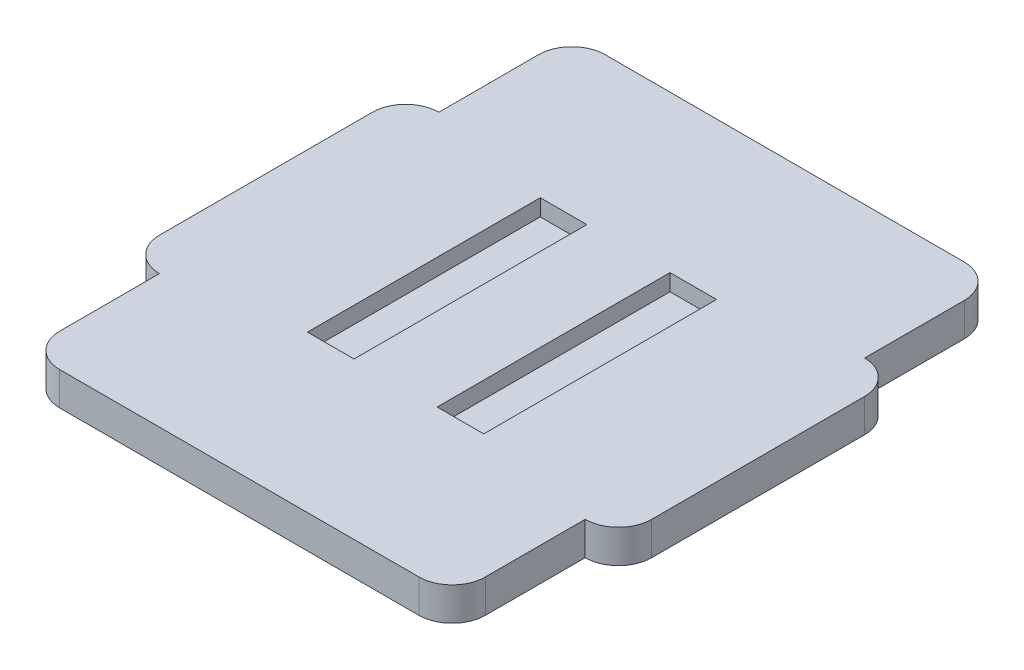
ISO-10303-21;
HEADER;
FILE_DESCRIPTION(('STEP AP214'),'2;1');
FILE_NAME('part.step','',(''),(''),'','','');
FILE_SCHEMA(('AUTOMOTIVE_DESIGN { 1 0 10303 214 1 1 1 1 }'));
ENDSEC;
DATA;
#1=APPLICATION_CONTEXT('core data for automotive mechanical design processes');
#2=APPLICATION_PROTOCOL_DEFINITION('international standard','automotive_design',2000,#1);
#3=PRODUCT_CONTEXT('',#1,'mechanical');
#4=PRODUCT('Part','Part','',(#3));
#5=PRODUCT_RELATED_PRODUCT_CATEGORY('part','',(#4));
#6=PRODUCT_DEFINITION_FORMATION('','',#4);
#7=PRODUCT_DEFINITION_CONTEXT('part definition',#1,'design');
#8=PRODUCT_DEFINITION('design','',#6,#7);
#9=PRODUCT_DEFINITION_SHAPE('','',#8);
#10=(LENGTH_UNIT() NAMED_UNIT(*) SI_UNIT(.MILLI.,.METRE.));
#11=(NAMED_UNIT(*) PLANE_ANGLE_UNIT() SI_UNIT($,.RADIAN.));
#12=(NAMED_UNIT(*) SI_UNIT($,.STERADIAN.) SOLID_ANGLE_UNIT());
#13=UNCERTAINTY_MEASURE_WITH_UNIT(LENGTH_MEASURE(1.E-05),#10,'distance_accuracy_value','');
#14=(GEOMETRIC_REPRESENTATION_CONTEXT(3) GLOBAL_UNCERTAINTY_ASSIGNED_CONTEXT((#13)) GLOBAL_UNIT_ASSIGNED_CONTEXT((#10,
#11,#12)) REPRESENTATION_CONTEXT('',''));
#15=CARTESIAN_POINT('',(0.,0.,0.));
#16=DIRECTION('',(0.,0.,1.));
#17=DIRECTION('',(1.,0.,0.));
#18=AXIS2_PLACEMENT_3D('',#15,#16,#17);
#19=CARTESIAN_POINT('',(46.,5.,-37.));
#20=DIRECTION('',(0.,-1.,0.));
#21=DIRECTION('',(0.,0.,-1.));
#22=AXIS2_PLACEMENT_3D('',#19,#20,#21);
#23=CYLINDRICAL_SURFACE('',#22,5.);
#24=CARTESIAN_POINT('',(46.,0.,-37.));
#25=DIRECTION('',(0.,1.,0.));
#26=DIRECTION('',(0.,0.,1.));
#27=AXIS2_PLACEMENT_3D('',#24,#25,#26);
#28=CIRCLE('',#27,5.);
#29=CARTESIAN_POINT('',(51.,0.,-37.));
#30=VERTEX_POINT('',#29);
#31=CARTESIAN_POINT('',(46.,0.,-42.));
#32=VERTEX_POINT('',#31);
#33=EDGE_CURVE('E251',#30,#32,#28,.T.);
#34=ORIENTED_EDGE('',*,*,#33,.T.);
#35=DIRECTION('',(0.,-1.,0.));
#36=VECTOR('',#35,1.);
#37=CARTESIAN_POINT('',(46.,5.,-42.));
#38=LINE('',#37,#36);
#39=CARTESIAN_POINT('',(46.,5.,-42.));
#40=VERTEX_POINT('',#39);
#41=EDGE_CURVE('E11',#40,#32,#38,.T.);
#42=ORIENTED_EDGE('',*,*,#41,.F.);
#43=CARTESIAN_POINT('',(46.,5.,-37.));
#44=DIRECTION('',(0.,1.,0.));
#45=DIRECTION('',(0.,0.,1.));
#46=AXIS2_PLACEMENT_3D('',#43,#44,#45);
#47=CIRCLE('',#46,5.);
#48=CARTESIAN_POINT('',(51.,5.,-37.));
#49=VERTEX_POINT('',#48);
#50=EDGE_CURVE('E299',#49,#40,#47,.T.);
#51=ORIENTED_EDGE('',*,*,#50,.F.);
#52=DIRECTION('',(0.,-1.,0.));
#53=VECTOR('',#52,1.);
#54=CARTESIAN_POINT('',(51.,5.,-37.));
#55=LINE('',#54,#53);
#56=EDGE_CURVE('E357',#49,#30,#55,.T.);
#57=ORIENTED_EDGE('',*,*,#56,.T.);
#58=EDGE_LOOP('',(#34,#42,#51,#57));
#59=FACE_BOUND('',#58,.T.);
#60=ADVANCED_FACE('F45',(#59),#23,.T.);
#61=CARTESIAN_POINT('',(46.,5.,0.));
#62=DIRECTION('',(-1.,0.,0.));
#63=DIRECTION('',(0.,0.,1.));
#64=AXIS2_PLACEMENT_3D('',#61,#62,#63);
#65=PLANE('',#64);
#66=DIRECTION('',(0.,0.,-1.));
#67=VECTOR('',#66,1.);
#68=CARTESIAN_POINT('',(46.,0.,0.));
#69=LINE('',#68,#67);
#70=CARTESIAN_POINT('',(46.,0.,-57.));
#71=VERTEX_POINT('',#70);
#72=EDGE_CURVE('E361',#32,#71,#69,.T.);
#73=ORIENTED_EDGE('',*,*,#72,.T.);
#74=DIRECTION('',(0.,-1.,0.));
#75=VECTOR('',#74,1.);
#76=CARTESIAN_POINT('',(46.,5.,-57.));
#77=LINE('',#76,#75);
#78=CARTESIAN_POINT('',(46.,5.,-57.));
#79=VERTEX_POINT('',#78);
#80=EDGE_CURVE('E53',#79,#71,#77,.T.);
#81=ORIENTED_EDGE('',*,*,#80,.F.);
#82=DIRECTION('',(0.,0.,-1.));
#83=VECTOR('',#82,1.);
#84=CARTESIAN_POINT('',(46.,5.,0.));
#85=LINE('',#84,#83);
#86=EDGE_CURVE('E303',#40,#79,#85,.T.);
#87=ORIENTED_EDGE('',*,*,#86,.F.);
#88=ORIENTED_EDGE('',*,*,#41,.T.);
#89=EDGE_LOOP('',(#73,#81,#87,#88));
#90=FACE_BOUND('',#89,.T.);
#91=ADVANCED_FACE('F484',(#90),#65,.F.);
#92=CARTESIAN_POINT('',(41.,5.,-57.));
#93=DIRECTION('',(0.,-1.,0.));
#94=DIRECTION('',(0.,0.,-1.));
#95=AXIS2_PLACEMENT_3D('',#92,#93,#94);
#96=CYLINDRICAL_SURFACE('',#95,5.);
#97=CARTESIAN_POINT('',(41.,0.,-57.));
#98=DIRECTION('',(0.,1.,0.));
#99=DIRECTION('',(0.,0.,1.));
#100=AXIS2_PLACEMENT_3D('',#97,#98,#99);
#101=CIRCLE('',#100,5.);
#102=CARTESIAN_POINT('',(41.,0.,-62.));
#103=VERTEX_POINT('',#102);
#104=EDGE_CURVE('E364',#71,#103,#101,.T.);
#105=ORIENTED_EDGE('',*,*,#104,.T.);
#106=DIRECTION('',(0.,-1.,0.));
#107=VECTOR('',#106,1.);
#108=CARTESIAN_POINT('',(41.,5.,-62.));
#109=LINE('',#108,#107);
#110=CARTESIAN_POINT('',(41.,5.,-62.));
#111=VERTEX_POINT('',#110);
#112=EDGE_CURVE('E457',#111,#103,#109,.T.);
#113=ORIENTED_EDGE('',*,*,#112,.F.);
#114=CARTESIAN_POINT('',(41.,5.,-57.));
#115=DIRECTION('',(0.,1.,0.));
#116=DIRECTION('',(0.,0.,1.));
#117=AXIS2_PLACEMENT_3D('',#114,#115,#116);
#118=CIRCLE('',#117,5.);
#119=EDGE_CURVE('E307',#79,#111,#118,.T.);
#120=ORIENTED_EDGE('',*,*,#119,.F.);
#121=ORIENTED_EDGE('',*,*,#80,.T.);
#122=EDGE_LOOP('',(#105,#113,#120,#121));
#123=FACE_BOUND('',#122,.T.);
#124=ADVANCED_FACE('F465',(#123),#96,.T.);
#125=CARTESIAN_POINT('',(0.,5.,-62.));
#126=DIRECTION('',(0.,0.,-1.));
#127=DIRECTION('',(-1.,0.,0.));
#128=AXIS2_PLACEMENT_3D('',#125,#126,#127);
#129=PLANE('',#128);
#130=DIRECTION('',(1.,0.,0.));
#131=VECTOR('',#130,1.);
#132=CARTESIAN_POINT('',(0.,0.,-62.));
#133=LINE('',#132,#131);
#134=CARTESIAN_POINT('',(-13.,0.,-62.));
#135=VERTEX_POINT('',#134);
#136=EDGE_CURVE('E368',#135,#103,#133,.T.);
#137=ORIENTED_EDGE('',*,*,#136,.F.);
#138=DIRECTION('',(0.,-1.,0.));
#139=VECTOR('',#138,1.);
#140=CARTESIAN_POINT('',(-13.,5.,-62.));
#141=LINE('',#140,#139);
#142=CARTESIAN_POINT('',(-13.,5.,-62.));
#143=VERTEX_POINT('',#142);
#144=EDGE_CURVE('E454',#143,#135,#141,.T.);
#145=ORIENTED_EDGE('',*,*,#144,.F.);
#146=DIRECTION('',(1.,0.,0.));
#147=VECTOR('',#146,1.);
#148=CARTESIAN_POINT('',(0.,5.,-62.));
#149=LINE('',#148,#147);
#150=EDGE_CURVE('E310',#143,#111,#149,.T.);
#151=ORIENTED_EDGE('',*,*,#150,.T.);
#152=ORIENTED_EDGE('',*,*,#112,.T.);
#153=EDGE_LOOP('',(#137,#145,#151,#152));
#154=FACE_BOUND('',#153,.T.);
#155=ADVANCED_FACE('F474',(#154),#129,.T.);
#156=CARTESIAN_POINT('',(-13.,5.,-57.));
#157=DIRECTION('',(0.,-1.,0.));
#158=DIRECTION('',(0.,0.,-1.));
#159=AXIS2_PLACEMENT_3D('',#156,#157,#158);
#160=CYLINDRICAL_SURFACE('',#159,5.);
#161=CARTESIAN_POINT('',(-13.,0.,-57.));
#162=DIRECTION('',(0.,1.,0.));
#163=DIRECTION('',(0.,0.,1.));
#164=AXIS2_PLACEMENT_3D('',#161,#162,#163);
#165=CIRCLE('',#164,5.);
#166=CARTESIAN_POINT('',(-18.,0.,-57.));
#167=VERTEX_POINT('',#166);
#168=EDGE_CURVE('E372',#135,#167,#165,.T.);
#169=ORIENTED_EDGE('',*,*,#168,.T.);
#170=DIRECTION('',(0.,-1.,0.));
#171=VECTOR('',#170,1.);
#172=CARTESIAN_POINT('',(-18.,5.,-57.));
#173=LINE('',#172,#171);
#174=CARTESIAN_POINT('',(-18.,5.,-57.));
#175=VERTEX_POINT('',#174);
#176=EDGE_CURVE('E451',#175,#167,#173,.T.);
#177=ORIENTED_EDGE('',*,*,#176,.F.);
#178=CARTESIAN_POINT('',(-13.,5.,-57.));
#179=DIRECTION('',(0.,1.,0.));
#180=DIRECTION('',(0.,0.,1.));
#181=AXIS2_PLACEMENT_3D('',#178,#179,#180);
#182=CIRCLE('',#181,5.);
#183=EDGE_CURVE('E314',#143,#175,#182,.T.);
#184=ORIENTED_EDGE('',*,*,#183,.F.);
#185=ORIENTED_EDGE('',*,*,#144,.T.);
#186=EDGE_LOOP('',(#169,#177,#184,#185));
#187=FACE_BOUND('',#186,.T.);
#188=ADVANCED_FACE('F532',(#187),#160,.T.);
#189=CARTESIAN_POINT('',(-18.,5.,0.));
#190=DIRECTION('',(-1.,0.,0.));
#191=DIRECTION('',(0.,0.,1.));
#192=AXIS2_PLACEMENT_3D('',#189,#190,#191);
#193=PLANE('',#192);
#194=DIRECTION('',(0.,0.,-1.));
#195=VECTOR('',#194,1.);
#196=CARTESIAN_POINT('',(-18.,0.,0.));
#197=LINE('',#196,#195);
#198=CARTESIAN_POINT('',(-18.,0.,-42.));
#199=VERTEX_POINT('',#198);
#200=EDGE_CURVE('E376',#199,#167,#197,.T.);
#201=ORIENTED_EDGE('',*,*,#200,.F.);
#202=DIRECTION('',(0.,-1.,0.));
#203=VECTOR('',#202,1.);
#204=CARTESIAN_POINT('',(-18.,5.,-42.));
#205=LINE('',#204,#203);
#206=CARTESIAN_POINT('',(-18.,5.,-42.));
#207=VERTEX_POINT('',#206);
#208=EDGE_CURVE('E448',#207,#199,#205,.T.);
#209=ORIENTED_EDGE('',*,*,#208,.F.);
#210=DIRECTION('',(0.,0.,-1.));
#211=VECTOR('',#210,1.);
#212=CARTESIAN_POINT('',(-18.,5.,0.));
#213=LINE('',#212,#211);
#214=EDGE_CURVE('E317',#207,#175,#213,.T.);
#215=ORIENTED_EDGE('',*,*,#214,.T.);
#216=ORIENTED_EDGE('',*,*,#176,.T.);
#217=EDGE_LOOP('',(#201,#209,#215,#216));
#218=FACE_BOUND('',#217,.T.);
#219=ADVANCED_FACE('F530',(#218),#193,.T.);
#220=CARTESIAN_POINT('',(-18.,5.,-37.));
#221=DIRECTION('',(0.,-1.,0.));
#222=DIRECTION('',(0.,0.,-1.));
#223=AXIS2_PLACEMENT_3D('',#220,#221,#222);
#224=CYLINDRICAL_SURFACE('',#223,5.);
#225=CARTESIAN_POINT('',(-18.,0.,-37.));
#226=DIRECTION('',(0.,1.,0.));
#227=DIRECTION('',(0.,0.,1.));
#228=AXIS2_PLACEMENT_3D('',#225,#226,#227);
#229=CIRCLE('',#228,5.);
#230=CARTESIAN_POINT('',(-23.,0.,-37.));
#231=VERTEX_POINT('',#230);
#232=EDGE_CURVE('E380',#231,#199,#229,.F.);
#233=ORIENTED_EDGE('',*,*,#232,.F.);
#234=DIRECTION('',(0.,-1.,0.));
#235=VECTOR('',#234,1.);
#236=CARTESIAN_POINT('',(-23.,5.,-37.));
#237=LINE('',#236,#235);
#238=CARTESIAN_POINT('',(-23.,5.,-37.));
#239=VERTEX_POINT('',#238);
#240=EDGE_CURVE('E445',#239,#231,#237,.T.);
#241=ORIENTED_EDGE('',*,*,#240,.F.);
#242=CARTESIAN_POINT('',(-18.,5.,-37.));
#243=DIRECTION('',(0.,1.,0.));
#244=DIRECTION('',(0.,0.,1.));
#245=AXIS2_PLACEMENT_3D('',#242,#243,#244);
#246=CIRCLE('',#245,5.);
#247=EDGE_CURVE('E321',#239,#207,#246,.F.);
#248=ORIENTED_EDGE('',*,*,#247,.T.);
#249=ORIENTED_EDGE('',*,*,#208,.T.);
#250=EDGE_LOOP('',(#233,#241,#248,#249));
#251=FACE_BOUND('',#250,.T.);
#252=ADVANCED_FACE('F527',(#251),#224,.T.);
#253=CARTESIAN_POINT('',(-23.,5.,0.));
#254=DIRECTION('',(-1.,0.,0.));
#255=DIRECTION('',(0.,0.,1.));
#256=AXIS2_PLACEMENT_3D('',#253,#254,#255);
#257=PLANE('',#256);
#258=DIRECTION('',(0.,0.,-1.));
#259=VECTOR('',#258,1.);
#260=CARTESIAN_POINT('',(-23.,0.,0.));
#261=LINE('',#260,#259);
#262=CARTESIAN_POINT('',(-23.,0.,-5.));
#263=VERTEX_POINT('',#262);
#264=EDGE_CURVE('E384',#263,#231,#261,.T.);
#265=ORIENTED_EDGE('',*,*,#264,.F.);
#266=DIRECTION('',(0.,-1.,0.));
#267=VECTOR('',#266,1.);
#268=CARTESIAN_POINT('',(-23.,5.,-5.));
#269=LINE('',#268,#267);
#270=CARTESIAN_POINT('',(-23.,5.,-5.));
#271=VERTEX_POINT('',#270);
#272=EDGE_CURVE('E442',#271,#263,#269,.T.);
#273=ORIENTED_EDGE('',*,*,#272,.F.);
#274=DIRECTION('',(0.,0.,-1.));
#275=VECTOR('',#274,1.);
#276=CARTESIAN_POINT('',(-23.,5.,0.));
#277=LINE('',#276,#275);
#278=EDGE_CURVE('E325',#271,#239,#277,.T.);
#279=ORIENTED_EDGE('',*,*,#278,.T.);
#280=ORIENTED_EDGE('',*,*,#240,.T.);
#281=EDGE_LOOP('',(#265,#273,#279,#280));
#282=FACE_BOUND('',#281,.T.);
#283=ADVANCED_FACE('F523',(#282),#257,.T.);
#284=CARTESIAN_POINT('',(-18.,5.,-5.));
#285=DIRECTION('',(0.,-1.,0.));
#286=DIRECTION('',(0.,0.,-1.));
#287=AXIS2_PLACEMENT_3D('',#284,#285,#286);
#288=CYLINDRICAL_SURFACE('',#287,5.);
#289=CARTESIAN_POINT('',(-18.,0.,-5.));
#290=DIRECTION('',(0.,1.,0.));
#291=DIRECTION('',(0.,0.,1.));
#292=AXIS2_PLACEMENT_3D('',#289,#290,#291);
#293=CIRCLE('',#292,5.);
#294=CARTESIAN_POINT('',(-18.,0.,0.));
#295=VERTEX_POINT('',#294);
#296=EDGE_CURVE('E388',#295,#263,#293,.F.);
#297=ORIENTED_EDGE('',*,*,#296,.F.);
#298=DIRECTION('',(0.,-1.,0.));
#299=VECTOR('',#298,1.);
#300=CARTESIAN_POINT('',(-18.,5.,0.));
#301=LINE('',#300,#299);
#302=CARTESIAN_POINT('',(-18.,5.,0.));
#303=VERTEX_POINT('',#302);
#304=EDGE_CURVE('E439',#303,#295,#301,.T.);
#305=ORIENTED_EDGE('',*,*,#304,.F.);
#306=CARTESIAN_POINT('',(-18.,5.,-5.));
#307=DIRECTION('',(0.,1.,0.));
#308=DIRECTION('',(0.,0.,1.));
#309=AXIS2_PLACEMENT_3D('',#306,#307,#308);
#310=CIRCLE('',#309,5.);
#311=EDGE_CURVE('E329',#303,#271,#310,.F.);
#312=ORIENTED_EDGE('',*,*,#311,.T.);
#313=ORIENTED_EDGE('',*,*,#272,.T.);
#314=EDGE_LOOP('',(#297,#305,#312,#313));
#315=FACE_BOUND('',#314,.T.);
#316=ADVANCED_FACE('F518',(#315),#288,.T.);
#317=CARTESIAN_POINT('',(-18.,5.,0.));
#318=DIRECTION('',(1.,0.,0.));
#319=DIRECTION('',(0.,0.,-1.));
#320=AXIS2_PLACEMENT_3D('',#317,#318,#319);
#321=PLANE('',#320);
#322=DIRECTION('',(0.,0.,1.));
#323=VECTOR('',#322,1.);
#324=CARTESIAN_POINT('',(-18.,0.,0.));
#325=LINE('',#324,#323);
#326=CARTESIAN_POINT('',(-18.,0.,15.));
#327=VERTEX_POINT('',#326);
#328=EDGE_CURVE('E392',#295,#327,#325,.T.);
#329=ORIENTED_EDGE('',*,*,#328,.T.);
#330=DIRECTION('',(0.,-1.,0.));
#331=VECTOR('',#330,1.);
#332=CARTESIAN_POINT('',(-18.,5.,15.));
#333=LINE('',#332,#331);
#334=CARTESIAN_POINT('',(-18.,5.,15.));
#335=VERTEX_POINT('',#334);
#336=EDGE_CURVE('E436',#335,#327,#333,.T.);
#337=ORIENTED_EDGE('',*,*,#336,.F.);
#338=DIRECTION('',(0.,0.,1.));
#339=VECTOR('',#338,1.);
#340=CARTESIAN_POINT('',(-18.,5.,0.));
#341=LINE('',#340,#339);
#342=EDGE_CURVE('E333',#303,#335,#341,.T.);
#343=ORIENTED_EDGE('',*,*,#342,.F.);
#344=ORIENTED_EDGE('',*,*,#304,.T.);
#345=EDGE_LOOP('',(#329,#337,#343,#344));
#346=FACE_BOUND('',#345,.T.);
#347=ADVANCED_FACE('F515',(#346),#321,.F.);
#348=CARTESIAN_POINT('',(-13.,5.,15.));
#349=DIRECTION('',(0.,-1.,0.));
#350=DIRECTION('',(0.,0.,-1.));
#351=AXIS2_PLACEMENT_3D('',#348,#349,#350);
#352=CYLINDRICAL_SURFACE('',#351,5.);
#353=CARTESIAN_POINT('',(-13.,0.,15.));
#354=DIRECTION('',(0.,1.,0.));
#355=DIRECTION('',(0.,0.,1.));
#356=AXIS2_PLACEMENT_3D('',#353,#354,#355);
#357=CIRCLE('',#356,5.);
#358=CARTESIAN_POINT('',(-13.,0.,20.));
#359=VERTEX_POINT('',#358);
#360=EDGE_CURVE('E396',#359,#327,#357,.F.);
#361=ORIENTED_EDGE('',*,*,#360,.F.);
#362=DIRECTION('',(0.,-1.,0.));
#363=VECTOR('',#362,1.);
#364=CARTESIAN_POINT('',(-13.,5.,20.));
#365=LINE('',#364,#363);
#366=CARTESIAN_POINT('',(-13.,5.,20.));
#367=VERTEX_POINT('',#366);
#368=EDGE_CURVE('E433',#367,#359,#365,.T.);
#369=ORIENTED_EDGE('',*,*,#368,.F.);
#370=CARTESIAN_POINT('',(-13.,5.,15.));
#371=DIRECTION('',(0.,1.,0.));
#372=DIRECTION('',(0.,0.,1.));
#373=AXIS2_PLACEMENT_3D('',#370,#371,#372);
#374=CIRCLE('',#373,5.);
#375=EDGE_CURVE('E336',#367,#335,#374,.F.);
#376=ORIENTED_EDGE('',*,*,#375,.T.);
#377=ORIENTED_EDGE('',*,*,#336,.T.);
#378=EDGE_LOOP('',(#361,#369,#376,#377));
#379=FACE_BOUND('',#378,.T.);
#380=ADVANCED_FACE('F509',(#379),#352,.T.);
#381=CARTESIAN_POINT('',(0.,5.,20.));
#382=DIRECTION('',(0.,0.,-1.));
#383=DIRECTION('',(-1.,0.,0.));
#384=AXIS2_PLACEMENT_3D('',#381,#382,#383);
#385=PLANE('',#384);
#386=DIRECTION('',(1.,0.,0.));
#387=VECTOR('',#386,1.);
#388=CARTESIAN_POINT('',(0.,0.,20.));
#389=LINE('',#388,#387);
#390=CARTESIAN_POINT('',(41.,0.,20.));
#391=VERTEX_POINT('',#390);
#392=EDGE_CURVE('E400',#359,#391,#389,.T.);
#393=ORIENTED_EDGE('',*,*,#392,.T.);
#394=DIRECTION('',(0.,-1.,0.));
#395=VECTOR('',#394,1.);
#396=CARTESIAN_POINT('',(41.,5.,20.));
#397=LINE('',#396,#395);
#398=CARTESIAN_POINT('',(41.,5.,20.));
#399=VERTEX_POINT('',#398);
#400=EDGE_CURVE('E429',#399,#391,#397,.T.);
#401=ORIENTED_EDGE('',*,*,#400,.F.);
#402=DIRECTION('',(1.,0.,0.));
#403=VECTOR('',#402,1.);
#404=CARTESIAN_POINT('',(0.,5.,20.));
#405=LINE('',#404,#403);
#406=EDGE_CURVE('E340',#367,#399,#405,.T.);
#407=ORIENTED_EDGE('',*,*,#406,.F.);
#408=ORIENTED_EDGE('',*,*,#368,.T.);
#409=EDGE_LOOP('',(#393,#401,#407,#408));
#410=FACE_BOUND('',#409,.T.);
#411=ADVANCED_FACE('F613',(#410),#385,.F.);
#412=CARTESIAN_POINT('',(41.,5.,15.));
#413=DIRECTION('',(0.,-1.,0.));
#414=DIRECTION('',(0.,0.,-1.));
#415=AXIS2_PLACEMENT_3D('',#412,#413,#414);
#416=CYLINDRICAL_SURFACE('',#415,5.);
#417=CARTESIAN_POINT('',(41.,0.,15.));
#418=DIRECTION('',(0.,1.,0.));
#419=DIRECTION('',(0.,0.,1.));
#420=AXIS2_PLACEMENT_3D('',#417,#418,#419);
#421=CIRCLE('',#420,5.);
#422=CARTESIAN_POINT('',(46.,0.,15.));
#423=VERTEX_POINT('',#422);
#424=EDGE_CURVE('E403',#391,#423,#421,.T.);
#425=ORIENTED_EDGE('',*,*,#424,.T.);
#426=DIRECTION('',(0.,-1.,0.));
#427=VECTOR('',#426,1.);
#428=CARTESIAN_POINT('',(46.,5.,15.));
#429=LINE('',#428,#427);
#430=CARTESIAN_POINT('',(46.,5.,15.));
#431=VERTEX_POINT('',#430);
#432=EDGE_CURVE('E426',#431,#423,#429,.T.);
#433=ORIENTED_EDGE('',*,*,#432,.F.);
#434=CARTESIAN_POINT('',(41.,5.,15.));
#435=DIRECTION('',(0.,1.,0.));
#436=DIRECTION('',(0.,0.,1.));
#437=AXIS2_PLACEMENT_3D('',#434,#435,#436);
#438=CIRCLE('',#437,5.);
#439=EDGE_CURVE('E343',#399,#431,#438,.T.);
#440=ORIENTED_EDGE('',*,*,#439,.F.);
#441=ORIENTED_EDGE('',*,*,#400,.T.);
#442=EDGE_LOOP('',(#425,#433,#440,#441));
#443=FACE_BOUND('',#442,.T.);
#444=ADVANCED_FACE('F502',(#443),#416,.T.);
#445=CARTESIAN_POINT('',(46.,5.,0.));
#446=DIRECTION('',(1.,0.,0.));
#447=DIRECTION('',(0.,0.,-1.));
#448=AXIS2_PLACEMENT_3D('',#445,#446,#447);
#449=PLANE('',#448);
#450=DIRECTION('',(0.,0.,1.));
#451=VECTOR('',#450,1.);
#452=CARTESIAN_POINT('',(46.,0.,0.));
#453=LINE('',#452,#451);
#454=CARTESIAN_POINT('',(46.,0.,0.));
#455=VERTEX_POINT('',#454);
#456=EDGE_CURVE('E407',#455,#423,#453,.T.);
#457=ORIENTED_EDGE('',*,*,#456,.F.);
#458=DIRECTION('',(0.,-1.,0.));
#459=VECTOR('',#458,1.);
#460=CARTESIAN_POINT('',(46.,5.,0.));
#461=LINE('',#460,#459);
#462=CARTESIAN_POINT('',(46.,5.,0.));
#463=VERTEX_POINT('',#462);
#464=EDGE_CURVE('E423',#463,#455,#461,.T.);
#465=ORIENTED_EDGE('',*,*,#464,.F.);
#466=DIRECTION('',(0.,0.,1.));
#467=VECTOR('',#466,1.);
#468=CARTESIAN_POINT('',(46.,5.,0.));
#469=LINE('',#468,#467);
#470=EDGE_CURVE('E346',#463,#431,#469,.T.);
#471=ORIENTED_EDGE('',*,*,#470,.T.);
#472=ORIENTED_EDGE('',*,*,#432,.T.);
#473=EDGE_LOOP('',(#457,#465,#471,#472));
#474=FACE_BOUND('',#473,.T.);
#475=ADVANCED_FACE('F497',(#474),#449,.T.);
#476=CARTESIAN_POINT('',(46.,5.,-5.));
#477=DIRECTION('',(0.,-1.,0.));
#478=DIRECTION('',(0.,0.,-1.));
#479=AXIS2_PLACEMENT_3D('',#476,#477,#478);
#480=CYLINDRICAL_SURFACE('',#479,5.);
#481=CARTESIAN_POINT('',(46.,0.,-5.));
#482=DIRECTION('',(0.,1.,0.));
#483=DIRECTION('',(0.,0.,1.));
#484=AXIS2_PLACEMENT_3D('',#481,#482,#483);
#485=CIRCLE('',#484,5.);
#486=CARTESIAN_POINT('',(51.,0.,-5.00000000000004));
#487=VERTEX_POINT('',#486);
#488=EDGE_CURVE('E411',#455,#487,#485,.T.);
#489=ORIENTED_EDGE('',*,*,#488,.T.);
#490=DIRECTION('',(0.,-1.,0.));
#491=VECTOR('',#490,1.);
#492=CARTESIAN_POINT('',(51.,5.,-5.00000000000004));
#493=LINE('',#492,#491);
#494=CARTESIAN_POINT('',(51.,5.,-5.00000000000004));
#495=VERTEX_POINT('',#494);
#496=EDGE_CURVE('E420',#495,#487,#493,.T.);
#497=ORIENTED_EDGE('',*,*,#496,.F.);
#498=CARTESIAN_POINT('',(46.,5.,-5.));
#499=DIRECTION('',(0.,1.,0.));
#500=DIRECTION('',(0.,0.,1.));
#501=AXIS2_PLACEMENT_3D('',#498,#499,#500);
#502=CIRCLE('',#501,5.);
#503=EDGE_CURVE('E350',#463,#495,#502,.T.);
#504=ORIENTED_EDGE('',*,*,#503,.F.);
#505=ORIENTED_EDGE('',*,*,#464,.T.);
#506=EDGE_LOOP('',(#489,#497,#504,#505));
#507=FACE_BOUND('',#506,.T.);
#508=ADVANCED_FACE('F493',(#507),#480,.T.);
#509=CARTESIAN_POINT('',(51.,5.,0.));
#510=DIRECTION('',(1.,0.,0.));
#511=DIRECTION('',(0.,0.,-1.));
#512=AXIS2_PLACEMENT_3D('',#509,#510,#511);
#513=PLANE('',#512);
#514=DIRECTION('',(0.,0.,1.));
#515=VECTOR('',#514,1.);
#516=CARTESIAN_POINT('',(51.,0.,0.));
#517=LINE('',#516,#515);
#518=EDGE_CURVE('E304',#30,#487,#517,.T.);
#519=ORIENTED_EDGE('',*,*,#518,.F.);
#520=ORIENTED_EDGE('',*,*,#56,.F.);
#521=DIRECTION('',(0.,0.,1.));
#522=VECTOR('',#521,1.);
#523=CARTESIAN_POINT('',(51.,5.,0.));
#524=LINE('',#523,#522);
#525=EDGE_CURVE('E353',#49,#495,#524,.T.);
#526=ORIENTED_EDGE('',*,*,#525,.T.);
#527=ORIENTED_EDGE('',*,*,#496,.T.);
#528=EDGE_LOOP('',(#519,#520,#526,#527));
#529=FACE_BOUND('',#528,.T.);
#530=ADVANCED_FACE('F489',(#529),#513,.T.);
#531=CARTESIAN_POINT('',(0.,5.,0.));
#532=DIRECTION('',(0.,1.,0.));
#533=DIRECTION('',(0.,0.,1.));
#534=AXIS2_PLACEMENT_3D('',#531,#532,#533);
#535=PLANE('',#534);
#536=DIRECTION('',(0.,0.,1.));
#537=VECTOR('',#536,1.);
#538=CARTESIAN_POINT('',(0.750000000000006,5.,-38.5));
#539=LINE('',#538,#537);
#540=CARTESIAN_POINT('',(0.750000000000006,5.,-38.5));
#541=VERTEX_POINT('',#540);
#542=CARTESIAN_POINT('',(0.750000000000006,5.,-3.5));
#543=VERTEX_POINT('',#542);
#544=EDGE_CURVE('E60',#541,#543,#539,.T.);
#545=ORIENTED_EDGE('',*,*,#544,.F.);
#546=DIRECTION('',(-1.,0.,0.));
#547=VECTOR('',#546,1.);
#548=CARTESIAN_POINT('',(0.750000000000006,5.,-38.5));
#549=LINE('',#548,#547);
#550=CARTESIAN_POINT('',(7.75000000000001,5.,-38.5));
#551=VERTEX_POINT('',#550);
#552=EDGE_CURVE('E229',#551,#541,#549,.T.);
#553=ORIENTED_EDGE('',*,*,#552,.F.);
#554=DIRECTION('',(0.,0.,-1.));
#555=VECTOR('',#554,1.);
#556=CARTESIAN_POINT('',(7.75000000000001,5.,-38.5));
#557=LINE('',#556,#555);
#558=CARTESIAN_POINT('',(7.75000000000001,5.,-3.5));
#559=VERTEX_POINT('',#558);
#560=EDGE_CURVE('E233',#559,#551,#557,.T.);
#561=ORIENTED_EDGE('',*,*,#560,.F.);
#562=DIRECTION('',(1.,0.,0.));
#563=VECTOR('',#562,1.);
#564=CARTESIAN_POINT('',(0.750000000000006,5.,-3.5));
#565=LINE('',#564,#563);
#566=EDGE_CURVE('E242',#543,#559,#565,.T.);
#567=ORIENTED_EDGE('',*,*,#566,.F.);
#568=EDGE_LOOP('',(#545,#553,#561,#567));
#569=FACE_BOUND('',#568,.T.);
#570=DIRECTION('',(0.,0.,-1.));
#571=VECTOR('',#570,1.);
#572=CARTESIAN_POINT('',(27.25,5.,-38.5));
#573=LINE('',#572,#571);
#574=CARTESIAN_POINT('',(27.25,5.,-3.5));
#575=VERTEX_POINT('',#574);
#576=CARTESIAN_POINT('',(27.25,5.,-38.5));
#577=VERTEX_POINT('',#576);
#578=EDGE_CURVE('E68',#575,#577,#573,.T.);
#579=ORIENTED_EDGE('',*,*,#578,.F.);
#580=DIRECTION('',(1.,0.,0.));
#581=VECTOR('',#580,1.);
#582=CARTESIAN_POINT('',(27.25,5.,-3.5));
#583=LINE('',#582,#581);
#584=CARTESIAN_POINT('',(20.25,5.,-3.5));
#585=VERTEX_POINT('',#584);
#586=EDGE_CURVE('E270',#585,#575,#583,.T.);
#587=ORIENTED_EDGE('',*,*,#586,.F.);
#588=DIRECTION('',(0.,0.,1.));
#589=VECTOR('',#588,1.);
#590=CARTESIAN_POINT('',(20.25,5.,-38.5));
#591=LINE('',#590,#589);
#592=CARTESIAN_POINT('',(20.25,5.,-38.5));
#593=VERTEX_POINT('',#592);
#594=EDGE_CURVE('E274',#593,#585,#591,.T.);
#595=ORIENTED_EDGE('',*,*,#594,.F.);
#596=DIRECTION('',(-1.,0.,0.));
#597=VECTOR('',#596,1.);
#598=CARTESIAN_POINT('',(27.25,5.,-38.5));
#599=LINE('',#598,#597);
#600=EDGE_CURVE('E279',#577,#593,#599,.T.);
#601=ORIENTED_EDGE('',*,*,#600,.F.);
#602=EDGE_LOOP('',(#579,#587,#595,#601));
#603=FACE_BOUND('',#602,.T.);
#604=ORIENTED_EDGE('',*,*,#50,.T.);
#605=ORIENTED_EDGE('',*,*,#86,.T.);
#606=ORIENTED_EDGE('',*,*,#119,.T.);
#607=ORIENTED_EDGE('',*,*,#150,.F.);
#608=ORIENTED_EDGE('',*,*,#183,.T.);
#609=ORIENTED_EDGE('',*,*,#214,.F.);
#610=ORIENTED_EDGE('',*,*,#247,.F.);
#611=ORIENTED_EDGE('',*,*,#278,.F.);
#612=ORIENTED_EDGE('',*,*,#311,.F.);
#613=ORIENTED_EDGE('',*,*,#342,.T.);
#614=ORIENTED_EDGE('',*,*,#375,.F.);
#615=ORIENTED_EDGE('',*,*,#406,.T.);
#616=ORIENTED_EDGE('',*,*,#439,.T.);
#617=ORIENTED_EDGE('',*,*,#470,.F.);
#618=ORIENTED_EDGE('',*,*,#503,.T.);
#619=ORIENTED_EDGE('',*,*,#525,.F.);
#620=EDGE_LOOP('',(#604,#605,#606,#607,#608,#609,#610,#611,#612,#613,#614,#615,#616,#617,#618,#619));
#621=FACE_BOUND('',#620,.T.);
#622=ADVANCED_FACE('F478',(#569,#603,#621),#535,.T.);
#623=CARTESIAN_POINT('',(0.,0.,0.));
#624=DIRECTION('',(0.,1.,0.));
#625=DIRECTION('',(0.,0.,1.));
#626=AXIS2_PLACEMENT_3D('',#623,#624,#625);
#627=PLANE('',#626);
#628=ORIENTED_EDGE('',*,*,#33,.F.);
#629=ORIENTED_EDGE('',*,*,#518,.T.);
#630=ORIENTED_EDGE('',*,*,#488,.F.);
#631=ORIENTED_EDGE('',*,*,#456,.T.);
#632=ORIENTED_EDGE('',*,*,#424,.F.);
#633=ORIENTED_EDGE('',*,*,#392,.F.);
#634=ORIENTED_EDGE('',*,*,#360,.T.);
#635=ORIENTED_EDGE('',*,*,#328,.F.);
#636=ORIENTED_EDGE('',*,*,#296,.T.);
#637=ORIENTED_EDGE('',*,*,#264,.T.);
#638=ORIENTED_EDGE('',*,*,#232,.T.);
#639=ORIENTED_EDGE('',*,*,#200,.T.);
#640=ORIENTED_EDGE('',*,*,#168,.F.);
#641=ORIENTED_EDGE('',*,*,#136,.T.);
#642=ORIENTED_EDGE('',*,*,#104,.F.);
#643=ORIENTED_EDGE('',*,*,#72,.F.);
#644=EDGE_LOOP('',(#628,#629,#630,#631,#632,#633,#634,#635,#636,#637,#638,#639,#640,#641,#642,#643));
#645=FACE_BOUND('',#644,.T.);
#646=ADVANCED_FACE('F470',(#645),#627,.F.);
#647=CARTESIAN_POINT('',(27.25,2.5,-38.5));
#648=DIRECTION('',(1.,0.,0.));
#649=DIRECTION('',(0.,0.,-1.));
#650=AXIS2_PLACEMENT_3D('',#647,#648,#649);
#651=PLANE('',#650);
#652=ORIENTED_EDGE('',*,*,#578,.T.);
#653=DIRECTION('',(0.,1.,0.));
#654=VECTOR('',#653,1.);
#655=CARTESIAN_POINT('',(27.25,2.5,-38.5));
#656=LINE('',#655,#654);
#657=CARTESIAN_POINT('',(27.25,2.5,-38.5));
#658=VERTEX_POINT('',#657);
#659=EDGE_CURVE('E257',#658,#577,#656,.T.);
#660=ORIENTED_EDGE('',*,*,#659,.F.);
#661=DIRECTION('',(0.,0.,-1.));
#662=VECTOR('',#661,1.);
#663=CARTESIAN_POINT('',(27.25,2.5,-38.5));
#664=LINE('',#663,#662);
#665=CARTESIAN_POINT('',(27.25,2.5,-3.5));
#666=VERTEX_POINT('',#665);
#667=EDGE_CURVE('E275',#666,#658,#664,.T.);
#668=ORIENTED_EDGE('',*,*,#667,.F.);
#669=DIRECTION('',(0.,1.,0.));
#670=VECTOR('',#669,1.);
#671=CARTESIAN_POINT('',(27.25,2.5,-3.5));
#672=LINE('',#671,#670);
#673=EDGE_CURVE('E267',#666,#575,#672,.T.);
#674=ORIENTED_EDGE('',*,*,#673,.T.);
#675=EDGE_LOOP('',(#652,#660,#668,#674));
#676=FACE_BOUND('',#675,.T.);
#677=ADVANCED_FACE('F670',(#676),#651,.F.);
#678=CARTESIAN_POINT('',(27.25,2.5,-3.5));
#679=DIRECTION('',(0.,0.,1.));
#680=DIRECTION('',(1.,0.,0.));
#681=AXIS2_PLACEMENT_3D('',#678,#679,#680);
#682=PLANE('',#681);
#683=ORIENTED_EDGE('',*,*,#586,.T.);
#684=ORIENTED_EDGE('',*,*,#673,.F.);
#685=DIRECTION('',(1.,0.,0.));
#686=VECTOR('',#685,1.);
#687=CARTESIAN_POINT('',(27.25,2.5,-3.5));
#688=LINE('',#687,#686);
#689=CARTESIAN_POINT('',(20.25,2.5,-3.5));
#690=VERTEX_POINT('',#689);
#691=EDGE_CURVE('E260',#690,#666,#688,.T.);
#692=ORIENTED_EDGE('',*,*,#691,.F.);
#693=DIRECTION('',(0.,1.,0.));
#694=VECTOR('',#693,1.);
#695=CARTESIAN_POINT('',(20.25,2.5,-3.5));
#696=LINE('',#695,#694);
#697=EDGE_CURVE('E264',#690,#585,#696,.T.);
#698=ORIENTED_EDGE('',*,*,#697,.T.);
#699=EDGE_LOOP('',(#683,#684,#692,#698));
#700=FACE_BOUND('',#699,.T.);
#701=ADVANCED_FACE('F689',(#700),#682,.F.);
#702=CARTESIAN_POINT('',(20.25,2.5,-38.5));
#703=DIRECTION('',(-1.,0.,0.));
#704=DIRECTION('',(0.,0.,1.));
#705=AXIS2_PLACEMENT_3D('',#702,#703,#704);
#706=PLANE('',#705);
#707=ORIENTED_EDGE('',*,*,#594,.T.);
#708=ORIENTED_EDGE('',*,*,#697,.F.);
#709=DIRECTION('',(0.,0.,1.));
#710=VECTOR('',#709,1.);
#711=CARTESIAN_POINT('',(20.25,2.5,-38.5));
#712=LINE('',#711,#710);
#713=CARTESIAN_POINT('',(20.25,2.5,-38.5));
#714=VERTEX_POINT('',#713);
#715=EDGE_CURVE('E288',#714,#690,#712,.T.);
#716=ORIENTED_EDGE('',*,*,#715,.F.);
#717=DIRECTION('',(0.,1.,0.));
#718=VECTOR('',#717,1.);
#719=CARTESIAN_POINT('',(20.25,2.5,-38.5));
#720=LINE('',#719,#718);
#721=EDGE_CURVE('E261',#714,#593,#720,.T.);
#722=ORIENTED_EDGE('',*,*,#721,.T.);
#723=EDGE_LOOP('',(#707,#708,#716,#722));
#724=FACE_BOUND('',#723,.T.);
#725=ADVANCED_FACE('F699',(#724),#706,.F.);
#726=CARTESIAN_POINT('',(27.25,2.5,-38.5));
#727=DIRECTION('',(0.,0.,-1.));
#728=DIRECTION('',(-1.,0.,0.));
#729=AXIS2_PLACEMENT_3D('',#726,#727,#728);
#730=PLANE('',#729);
#731=ORIENTED_EDGE('',*,*,#600,.T.);
#732=ORIENTED_EDGE('',*,*,#721,.F.);
#733=DIRECTION('',(-1.,0.,0.));
#734=VECTOR('',#733,1.);
#735=CARTESIAN_POINT('',(27.25,2.5,-38.5));
#736=LINE('',#735,#734);
#737=EDGE_CURVE('E292',#658,#714,#736,.T.);
#738=ORIENTED_EDGE('',*,*,#737,.F.);
#739=ORIENTED_EDGE('',*,*,#659,.T.);
#740=EDGE_LOOP('',(#731,#732,#738,#739));
#741=FACE_BOUND('',#740,.T.);
#742=ADVANCED_FACE('F710',(#741),#730,.F.);
#743=CARTESIAN_POINT('',(0.,2.5,0.));
#744=DIRECTION('',(0.,-1.,0.));
#745=DIRECTION('',(0.,0.,-1.));
#746=AXIS2_PLACEMENT_3D('',#743,#744,#745);
#747=PLANE('',#746);
#748=ORIENTED_EDGE('',*,*,#667,.T.);
#749=ORIENTED_EDGE('',*,*,#737,.T.);
#750=ORIENTED_EDGE('',*,*,#715,.T.);
#751=ORIENTED_EDGE('',*,*,#691,.T.);
#752=EDGE_LOOP('',(#748,#749,#750,#751));
#753=FACE_BOUND('',#752,.T.);
#754=ADVANCED_FACE('F721',(#753),#747,.F.);
#755=CARTESIAN_POINT('',(0.750000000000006,2.5,-38.5));
#756=DIRECTION('',(-1.,0.,0.));
#757=DIRECTION('',(0.,0.,1.));
#758=AXIS2_PLACEMENT_3D('',#755,#756,#757);
#759=PLANE('',#758);
#760=ORIENTED_EDGE('',*,*,#544,.T.);
#761=DIRECTION('',(0.,1.,0.));
#762=VECTOR('',#761,1.);
#763=CARTESIAN_POINT('',(0.750000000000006,2.5,-3.5));
#764=LINE('',#763,#762);
#765=CARTESIAN_POINT('',(0.750000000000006,2.5,-3.5));
#766=VERTEX_POINT('',#765);
#767=EDGE_CURVE('E204',#766,#543,#764,.T.);
#768=ORIENTED_EDGE('',*,*,#767,.F.);
#769=DIRECTION('',(0.,0.,1.));
#770=VECTOR('',#769,1.);
#771=CARTESIAN_POINT('',(0.750000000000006,2.5,-38.5));
#772=LINE('',#771,#770);
#773=CARTESIAN_POINT('',(0.750000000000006,2.5,-38.5));
#774=VERTEX_POINT('',#773);
#775=EDGE_CURVE('E208',#774,#766,#772,.T.);
#776=ORIENTED_EDGE('',*,*,#775,.F.);
#777=DIRECTION('',(0.,1.,0.));
#778=VECTOR('',#777,1.);
#779=CARTESIAN_POINT('',(0.750000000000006,2.5,-38.5));
#780=LINE('',#779,#778);
#781=EDGE_CURVE('E248',#774,#541,#780,.T.);
#782=ORIENTED_EDGE('',*,*,#781,.T.);
#783=EDGE_LOOP('',(#760,#768,#776,#782));
#784=FACE_BOUND('',#783,.T.);
#785=ADVANCED_FACE('F206',(#784),#759,.F.);
#786=CARTESIAN_POINT('',(0.750000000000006,2.5,-38.5));
#787=DIRECTION('',(0.,0.,-1.));
#788=DIRECTION('',(-1.,0.,0.));
#789=AXIS2_PLACEMENT_3D('',#786,#787,#788);
#790=PLANE('',#789);
#791=ORIENTED_EDGE('',*,*,#552,.T.);
#792=ORIENTED_EDGE('',*,*,#781,.F.);
#793=DIRECTION('',(-1.,0.,0.));
#794=VECTOR('',#793,1.);
#795=CARTESIAN_POINT('',(0.750000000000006,2.5,-38.5));
#796=LINE('',#795,#794);
#797=CARTESIAN_POINT('',(7.75000000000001,2.5,-38.5));
#798=VERTEX_POINT('',#797);
#799=EDGE_CURVE('E215',#798,#774,#796,.T.);
#800=ORIENTED_EDGE('',*,*,#799,.F.);
#801=DIRECTION('',(0.,1.,0.));
#802=VECTOR('',#801,1.);
#803=CARTESIAN_POINT('',(7.75000000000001,2.5,-38.5));
#804=LINE('',#803,#802);
#805=EDGE_CURVE('E252',#798,#551,#804,.T.);
#806=ORIENTED_EDGE('',*,*,#805,.T.);
#807=EDGE_LOOP('',(#791,#792,#800,#806));
#808=FACE_BOUND('',#807,.T.);
#809=ADVANCED_FACE('F742',(#808),#790,.F.);
#810=CARTESIAN_POINT('',(7.75000000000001,2.5,-38.5));
#811=DIRECTION('',(1.,0.,0.));
#812=DIRECTION('',(0.,0.,-1.));
#813=AXIS2_PLACEMENT_3D('',#810,#811,#812);
#814=PLANE('',#813);
#815=ORIENTED_EDGE('',*,*,#560,.T.);
#816=ORIENTED_EDGE('',*,*,#805,.F.);
#817=DIRECTION('',(0.,0.,-1.));
#818=VECTOR('',#817,1.);
#819=CARTESIAN_POINT('',(7.75000000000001,2.5,-38.5));
#820=LINE('',#819,#818);
#821=CARTESIAN_POINT('',(7.75000000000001,2.5,-3.5));
#822=VERTEX_POINT('',#821);
#823=EDGE_CURVE('E224',#822,#798,#820,.T.);
#824=ORIENTED_EDGE('',*,*,#823,.F.);
#825=DIRECTION('',(0.,1.,0.));
#826=VECTOR('',#825,1.);
#827=CARTESIAN_POINT('',(7.75000000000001,2.5,-3.5));
#828=LINE('',#827,#826);
#829=EDGE_CURVE('E214',#822,#559,#828,.T.);
#830=ORIENTED_EDGE('',*,*,#829,.T.);
#831=EDGE_LOOP('',(#815,#816,#824,#830));
#832=FACE_BOUND('',#831,.T.);
#833=ADVANCED_FACE('F752',(#832),#814,.F.);
#834=CARTESIAN_POINT('',(0.750000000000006,2.5,-3.5));
#835=DIRECTION('',(0.,0.,1.));
#836=DIRECTION('',(1.,0.,0.));
#837=AXIS2_PLACEMENT_3D('',#834,#835,#836);
#838=PLANE('',#837);
#839=ORIENTED_EDGE('',*,*,#566,.T.);
#840=ORIENTED_EDGE('',*,*,#829,.F.);
#841=DIRECTION('',(1.,0.,0.));
#842=VECTOR('',#841,1.);
#843=CARTESIAN_POINT('',(0.750000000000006,2.5,-3.5));
#844=LINE('',#843,#842);
#845=EDGE_CURVE('E218',#766,#822,#844,.T.);
#846=ORIENTED_EDGE('',*,*,#845,.F.);
#847=ORIENTED_EDGE('',*,*,#767,.T.);
#848=EDGE_LOOP('',(#839,#840,#846,#847));
#849=FACE_BOUND('',#848,.T.);
#850=ADVANCED_FACE('F219',(#849),#838,.F.);
#851=CARTESIAN_POINT('',(0.,2.5,0.));
#852=DIRECTION('',(0.,1.,0.));
#853=DIRECTION('',(0.,0.,1.));
#854=AXIS2_PLACEMENT_3D('',#851,#852,#853);
#855=PLANE('',#854);
#856=ORIENTED_EDGE('',*,*,#775,.T.);
#857=ORIENTED_EDGE('',*,*,#845,.T.);
#858=ORIENTED_EDGE('',*,*,#823,.T.);
#859=ORIENTED_EDGE('',*,*,#799,.T.);
#860=EDGE_LOOP('',(#856,#857,#858,#859));
#861=FACE_BOUND('',#860,.T.);
#862=ADVANCED_FACE('F226',(#861),#855,.T.);
#863=CLOSED_SHELL('',(#60,#91,#124,#155,#188,#219,#252,#283,#316,#347,#380,#411,#444,#475,#508,
#530,#622,#646,#677,#701,#725,#742,#754,#785,#809,#833,#850,#862));
#864=MANIFOLD_SOLID_BREP('B2',#863);
#865=ADVANCED_BREP_SHAPE_REPRESENTATION('',(#18,#864),#14);
#866=SHAPE_DEFINITION_REPRESENTATION(#9,#865);
ENDSEC;
END-ISO-10303-21;
